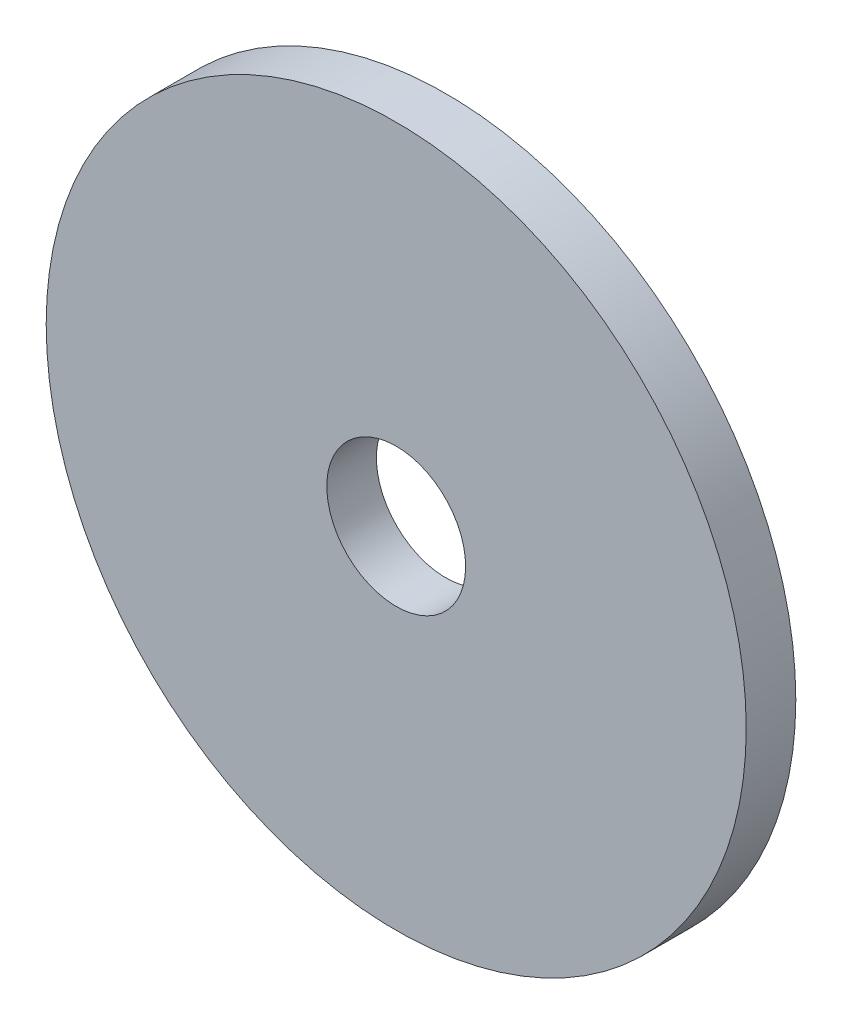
from build123d import *

# Parameters (mm, degrees)
SKETCH1_R   = 4.4831
SKETCH1_R_2 = 0.889
PLATE_DEPTH = 0.635


with BuildPart() as part:
    # Sketch1 → Plate (new body)
    with BuildSketch(Plane.XY):
        Circle(SKETCH1_R)
        Circle(SKETCH1_R_2, mode=Mode.SUBTRACT)
    extrude(amount=PLATE_DEPTH)


solid = part.part
